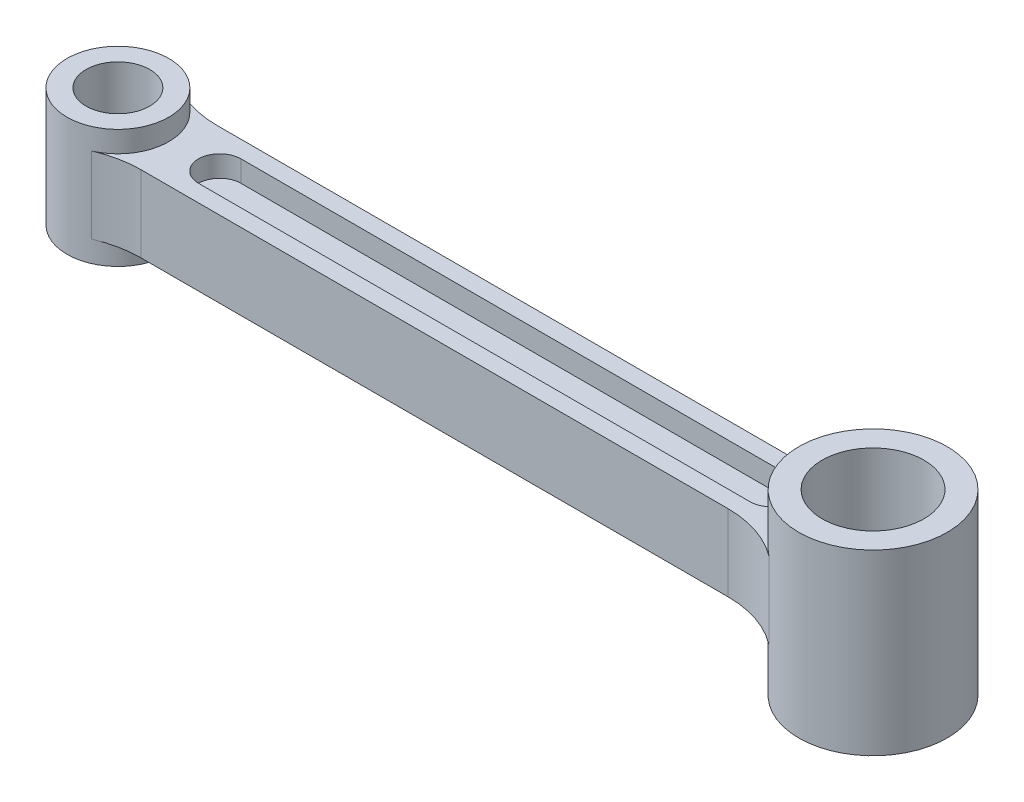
ISO-10303-21;
HEADER;
FILE_DESCRIPTION(('STEP AP214'),'2;1');
FILE_NAME('part.step','',(''),(''),'','','');
FILE_SCHEMA(('AUTOMOTIVE_DESIGN { 1 0 10303 214 1 1 1 1 }'));
ENDSEC;
DATA;
#1=APPLICATION_CONTEXT('core data for automotive mechanical design processes');
#2=APPLICATION_PROTOCOL_DEFINITION('international standard','automotive_design',2000,#1);
#3=PRODUCT_CONTEXT('',#1,'mechanical');
#4=PRODUCT('Part','Part','',(#3));
#5=PRODUCT_RELATED_PRODUCT_CATEGORY('part','',(#4));
#6=PRODUCT_DEFINITION_FORMATION('','',#4);
#7=PRODUCT_DEFINITION_CONTEXT('part definition',#1,'design');
#8=PRODUCT_DEFINITION('design','',#6,#7);
#9=PRODUCT_DEFINITION_SHAPE('','',#8);
#10=(LENGTH_UNIT() NAMED_UNIT(*) SI_UNIT(.MILLI.,.METRE.));
#11=(NAMED_UNIT(*) PLANE_ANGLE_UNIT() SI_UNIT($,.RADIAN.));
#12=(NAMED_UNIT(*) SI_UNIT($,.STERADIAN.) SOLID_ANGLE_UNIT());
#13=UNCERTAINTY_MEASURE_WITH_UNIT(LENGTH_MEASURE(1.E-05),#10,'distance_accuracy_value','');
#14=(GEOMETRIC_REPRESENTATION_CONTEXT(3) GLOBAL_UNCERTAINTY_ASSIGNED_CONTEXT((#13)) GLOBAL_UNIT_ASSIGNED_CONTEXT((#10,
#11,#12)) REPRESENTATION_CONTEXT('',''));
#15=CARTESIAN_POINT('',(0.,0.,0.));
#16=DIRECTION('',(0.,0.,1.));
#17=DIRECTION('',(1.,0.,0.));
#18=AXIS2_PLACEMENT_3D('',#15,#16,#17);
#19=CARTESIAN_POINT('',(-161.06840889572,-9.,0.));
#20=DIRECTION('',(0.,1.,0.));
#21=DIRECTION('',(0.,0.,1.));
#22=AXIS2_PLACEMENT_3D('',#19,#20,#21);
#23=PLANE('',#22);
#24=CARTESIAN_POINT('',(-89.,-9.,0.));
#25=DIRECTION('',(0.,1.,0.));
#26=DIRECTION('',(0.,0.,1.));
#27=AXIS2_PLACEMENT_3D('',#24,#25,#26);
#28=CIRCLE('',#27,12.);
#29=CARTESIAN_POINT('',(-84.2041684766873,-9.,11.));
#30=VERTEX_POINT('',#29);
#31=CARTESIAN_POINT('',(-84.2041684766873,-9.,-11.));
#32=VERTEX_POINT('',#31);
#33=EDGE_CURVE('E235',#30,#32,#28,.T.);
#34=ORIENTED_EDGE('',*,*,#33,.T.);
#35=CARTESIAN_POINT('',(-74.6125054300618,-9.,-33.));
#36=DIRECTION('',(0.,1.,0.));
#37=DIRECTION('',(0.,0.,1.));
#38=AXIS2_PLACEMENT_3D('',#35,#36,#37);
#39=CIRCLE('',#38,24.);
#40=CARTESIAN_POINT('',(-74.6125054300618,-9.,-9.));
#41=VERTEX_POINT('',#40);
#42=EDGE_CURVE('E243',#41,#32,#39,.F.);
#43=ORIENTED_EDGE('',*,*,#42,.F.);
#44=DIRECTION('',(1.,0.,0.));
#45=VECTOR('',#44,1.);
#46=CARTESIAN_POINT('',(-161.06840889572,-9.,-9.));
#47=LINE('',#46,#45);
#48=CARTESIAN_POINT('',(63.8355409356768,-9.,-9.));
#49=VERTEX_POINT('',#48);
#50=EDGE_CURVE('E276',#41,#49,#47,.T.);
#51=ORIENTED_EDGE('',*,*,#50,.T.);
#52=CARTESIAN_POINT('',(63.8355409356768,-9.,-33.));
#53=DIRECTION('',(0.,1.,0.));
#54=DIRECTION('',(0.,0.,1.));
#55=AXIS2_PLACEMENT_3D('',#52,#53,#54);
#56=CIRCLE('',#55,24.);
#57=CARTESIAN_POINT('',(78.3884811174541,-9.,-13.9156626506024));
#58=VERTEX_POINT('',#57);
#59=EDGE_CURVE('E274',#49,#58,#56,.T.);
#60=ORIENTED_EDGE('',*,*,#59,.T.);
#61=CARTESIAN_POINT('',(89.,-9.,0.));
#62=DIRECTION('',(0.,1.,0.));
#63=DIRECTION('',(0.,0.,1.));
#64=AXIS2_PLACEMENT_3D('',#61,#62,#63);
#65=CIRCLE('',#64,17.5);
#66=CARTESIAN_POINT('',(78.3884811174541,-9.,13.9156626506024));
#67=VERTEX_POINT('',#66);
#68=EDGE_CURVE('E271',#67,#58,#65,.F.);
#69=ORIENTED_EDGE('',*,*,#68,.F.);
#70=CARTESIAN_POINT('',(63.8355409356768,-9.,33.));
#71=DIRECTION('',(0.,1.,0.));
#72=DIRECTION('',(0.,0.,1.));
#73=AXIS2_PLACEMENT_3D('',#70,#71,#72);
#74=CIRCLE('',#73,24.);
#75=CARTESIAN_POINT('',(63.8355409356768,-9.,9.));
#76=VERTEX_POINT('',#75);
#77=EDGE_CURVE('E269',#76,#67,#74,.F.);
#78=ORIENTED_EDGE('',*,*,#77,.F.);
#79=DIRECTION('',(1.,0.,0.));
#80=VECTOR('',#79,1.);
#81=CARTESIAN_POINT('',(-161.06840889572,-9.,9.));
#82=LINE('',#81,#80);
#83=CARTESIAN_POINT('',(-74.6125054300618,-9.,9.));
#84=VERTEX_POINT('',#83);
#85=EDGE_CURVE('E267',#84,#76,#82,.T.);
#86=ORIENTED_EDGE('',*,*,#85,.F.);
#87=CARTESIAN_POINT('',(-74.6125054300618,-9.,33.));
#88=DIRECTION('',(0.,1.,0.));
#89=DIRECTION('',(0.,0.,1.));
#90=AXIS2_PLACEMENT_3D('',#87,#88,#89);
#91=CIRCLE('',#90,24.);
#92=EDGE_CURVE('E264',#84,#30,#91,.T.);
#93=ORIENTED_EDGE('',*,*,#92,.T.);
#94=EDGE_LOOP('',(#34,#43,#51,#60,#69,#78,#86,#93));
#95=FACE_BOUND('',#94,.T.);
#96=CARTESIAN_POINT('',(-65.,-9.,0.));
#97=DIRECTION('',(0.,1.,0.));
#98=DIRECTION('',(0.,0.,1.));
#99=AXIS2_PLACEMENT_3D('',#96,#97,#98);
#100=CIRCLE('',#99,5.);
#101=CARTESIAN_POINT('',(-65.,-9.,-5.));
#102=VERTEX_POINT('',#101);
#103=CARTESIAN_POINT('',(-65.,-9.,5.));
#104=VERTEX_POINT('',#103);
#105=EDGE_CURVE('E49',#102,#104,#100,.T.);
#106=ORIENTED_EDGE('',*,*,#105,.T.);
#107=DIRECTION('',(1.,0.,0.));
#108=VECTOR('',#107,1.);
#109=CARTESIAN_POINT('',(-65.,-9.,5.));
#110=LINE('',#109,#108);
#111=CARTESIAN_POINT('',(65.,-9.,5.));
#112=VERTEX_POINT('',#111);
#113=EDGE_CURVE('E167',#104,#112,#110,.T.);
#114=ORIENTED_EDGE('',*,*,#113,.T.);
#115=CARTESIAN_POINT('',(65.,-9.,0.));
#116=DIRECTION('',(0.,1.,0.));
#117=DIRECTION('',(0.,0.,1.));
#118=AXIS2_PLACEMENT_3D('',#115,#116,#117);
#119=CIRCLE('',#118,5.);
#120=CARTESIAN_POINT('',(65.,-9.,-5.));
#121=VERTEX_POINT('',#120);
#122=EDGE_CURVE('E170',#112,#121,#119,.T.);
#123=ORIENTED_EDGE('',*,*,#122,.T.);
#124=DIRECTION('',(-1.,0.,0.));
#125=VECTOR('',#124,1.);
#126=CARTESIAN_POINT('',(-65.,-9.,-5.));
#127=LINE('',#126,#125);
#128=EDGE_CURVE('E176',#121,#102,#127,.T.);
#129=ORIENTED_EDGE('',*,*,#128,.T.);
#130=EDGE_LOOP('',(#106,#114,#123,#129));
#131=FACE_BOUND('',#130,.T.);
#132=ADVANCED_FACE('F34',(#95,#131),#23,.F.);
#133=CARTESIAN_POINT('',(-74.6125054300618,9.,33.));
#134=DIRECTION('',(0.,-1.,0.));
#135=DIRECTION('',(0.,0.,-1.));
#136=AXIS2_PLACEMENT_3D('',#133,#134,#135);
#137=CYLINDRICAL_SURFACE('',#136,24.);
#138=ORIENTED_EDGE('',*,*,#92,.F.);
#139=DIRECTION('',(0.,-1.,0.));
#140=VECTOR('',#139,1.);
#141=CARTESIAN_POINT('',(-74.6125054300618,9.,9.));
#142=LINE('',#141,#140);
#143=CARTESIAN_POINT('',(-74.6125054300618,9.,9.));
#144=VERTEX_POINT('',#143);
#145=EDGE_CURVE('E42',#144,#84,#142,.T.);
#146=ORIENTED_EDGE('',*,*,#145,.F.);
#147=CARTESIAN_POINT('',(-74.6125054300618,9.,33.));
#148=DIRECTION('',(0.,1.,0.));
#149=DIRECTION('',(0.,0.,1.));
#150=AXIS2_PLACEMENT_3D('',#147,#148,#149);
#151=CIRCLE('',#150,24.);
#152=CARTESIAN_POINT('',(-84.2041684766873,9.,11.));
#153=VERTEX_POINT('',#152);
#154=EDGE_CURVE('E242',#144,#153,#151,.T.);
#155=ORIENTED_EDGE('',*,*,#154,.T.);
#156=DIRECTION('',(0.,-1.,0.));
#157=VECTOR('',#156,1.);
#158=CARTESIAN_POINT('',(-84.2041684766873,9.,11.));
#159=LINE('',#158,#157);
#160=EDGE_CURVE('E11',#153,#30,#159,.T.);
#161=ORIENTED_EDGE('',*,*,#160,.T.);
#162=EDGE_LOOP('',(#138,#146,#155,#161));
#163=FACE_BOUND('',#162,.T.);
#164=ADVANCED_FACE('F36',(#163),#137,.F.);
#165=CARTESIAN_POINT('',(-161.06840889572,9.,9.));
#166=DIRECTION('',(0.,0.,-1.));
#167=DIRECTION('',(-1.,0.,0.));
#168=AXIS2_PLACEMENT_3D('',#165,#166,#167);
#169=PLANE('',#168);
#170=ORIENTED_EDGE('',*,*,#85,.T.);
#171=DIRECTION('',(0.,-1.,0.));
#172=VECTOR('',#171,1.);
#173=CARTESIAN_POINT('',(63.8355409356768,9.,9.));
#174=LINE('',#173,#172);
#175=CARTESIAN_POINT('',(63.8355409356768,9.,9.));
#176=VERTEX_POINT('',#175);
#177=EDGE_CURVE('E292',#176,#76,#174,.T.);
#178=ORIENTED_EDGE('',*,*,#177,.F.);
#179=DIRECTION('',(1.,0.,0.));
#180=VECTOR('',#179,1.);
#181=CARTESIAN_POINT('',(-161.06840889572,9.,9.));
#182=LINE('',#181,#180);
#183=EDGE_CURVE('E246',#144,#176,#182,.T.);
#184=ORIENTED_EDGE('',*,*,#183,.F.);
#185=ORIENTED_EDGE('',*,*,#145,.T.);
#186=EDGE_LOOP('',(#170,#178,#184,#185));
#187=FACE_BOUND('',#186,.T.);
#188=ADVANCED_FACE('F297',(#187),#169,.F.);
#189=CARTESIAN_POINT('',(63.8355409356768,9.,33.));
#190=DIRECTION('',(0.,-1.,0.));
#191=DIRECTION('',(0.,0.,-1.));
#192=AXIS2_PLACEMENT_3D('',#189,#190,#191);
#193=CYLINDRICAL_SURFACE('',#192,24.);
#194=ORIENTED_EDGE('',*,*,#77,.T.);
#195=DIRECTION('',(0.,-1.,0.));
#196=VECTOR('',#195,1.);
#197=CARTESIAN_POINT('',(78.3884811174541,9.,13.9156626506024));
#198=LINE('',#197,#196);
#199=CARTESIAN_POINT('',(78.3884811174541,9.,13.9156626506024));
#200=VERTEX_POINT('',#199);
#201=EDGE_CURVE('E289',#200,#67,#198,.T.);
#202=ORIENTED_EDGE('',*,*,#201,.F.);
#203=CARTESIAN_POINT('',(63.8355409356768,9.,33.));
#204=DIRECTION('',(0.,1.,0.));
#205=DIRECTION('',(0.,0.,1.));
#206=AXIS2_PLACEMENT_3D('',#203,#204,#205);
#207=CIRCLE('',#206,24.);
#208=EDGE_CURVE('E248',#176,#200,#207,.F.);
#209=ORIENTED_EDGE('',*,*,#208,.F.);
#210=ORIENTED_EDGE('',*,*,#177,.T.);
#211=EDGE_LOOP('',(#194,#202,#209,#210));
#212=FACE_BOUND('',#211,.T.);
#213=ADVANCED_FACE('F333',(#212),#193,.F.);
#214=CARTESIAN_POINT('',(63.8355409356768,9.,-33.));
#215=DIRECTION('',(0.,-1.,0.));
#216=DIRECTION('',(0.,0.,-1.));
#217=AXIS2_PLACEMENT_3D('',#214,#215,#216);
#218=CYLINDRICAL_SURFACE('',#217,24.);
#219=ORIENTED_EDGE('',*,*,#59,.F.);
#220=DIRECTION('',(0.,-1.,0.));
#221=VECTOR('',#220,1.);
#222=CARTESIAN_POINT('',(63.8355409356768,9.,-9.));
#223=LINE('',#222,#221);
#224=CARTESIAN_POINT('',(63.8355409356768,9.,-9.));
#225=VERTEX_POINT('',#224);
#226=EDGE_CURVE('E284',#225,#49,#223,.T.);
#227=ORIENTED_EDGE('',*,*,#226,.F.);
#228=CARTESIAN_POINT('',(63.8355409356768,9.,-33.));
#229=DIRECTION('',(0.,1.,0.));
#230=DIRECTION('',(0.,0.,1.));
#231=AXIS2_PLACEMENT_3D('',#228,#229,#230);
#232=CIRCLE('',#231,24.);
#233=CARTESIAN_POINT('',(78.3884811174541,9.,-13.9156626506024));
#234=VERTEX_POINT('',#233);
#235=EDGE_CURVE('E252',#225,#234,#232,.T.);
#236=ORIENTED_EDGE('',*,*,#235,.T.);
#237=DIRECTION('',(0.,-1.,0.));
#238=VECTOR('',#237,1.);
#239=CARTESIAN_POINT('',(78.3884811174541,9.,-13.9156626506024));
#240=LINE('',#239,#238);
#241=EDGE_CURVE('E286',#234,#58,#240,.T.);
#242=ORIENTED_EDGE('',*,*,#241,.T.);
#243=EDGE_LOOP('',(#219,#227,#236,#242));
#244=FACE_BOUND('',#243,.T.);
#245=ADVANCED_FACE('F324',(#244),#218,.F.);
#246=CARTESIAN_POINT('',(-161.06840889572,9.,-9.));
#247=DIRECTION('',(0.,0.,-1.));
#248=DIRECTION('',(-1.,0.,0.));
#249=AXIS2_PLACEMENT_3D('',#246,#247,#248);
#250=PLANE('',#249);
#251=ORIENTED_EDGE('',*,*,#50,.F.);
#252=DIRECTION('',(0.,-1.,0.));
#253=VECTOR('',#252,1.);
#254=CARTESIAN_POINT('',(-74.6125054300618,9.,-9.));
#255=LINE('',#254,#253);
#256=CARTESIAN_POINT('',(-74.6125054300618,9.,-9.));
#257=VERTEX_POINT('',#256);
#258=EDGE_CURVE('E282',#257,#41,#255,.T.);
#259=ORIENTED_EDGE('',*,*,#258,.F.);
#260=DIRECTION('',(1.,0.,0.));
#261=VECTOR('',#260,1.);
#262=CARTESIAN_POINT('',(-161.06840889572,9.,-9.));
#263=LINE('',#262,#261);
#264=EDGE_CURVE('E255',#257,#225,#263,.T.);
#265=ORIENTED_EDGE('',*,*,#264,.T.);
#266=ORIENTED_EDGE('',*,*,#226,.T.);
#267=EDGE_LOOP('',(#251,#259,#265,#266));
#268=FACE_BOUND('',#267,.T.);
#269=ADVANCED_FACE('F321',(#268),#250,.T.);
#270=CARTESIAN_POINT('',(-74.6125054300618,9.,-33.));
#271=DIRECTION('',(0.,-1.,0.));
#272=DIRECTION('',(0.,0.,-1.));
#273=AXIS2_PLACEMENT_3D('',#270,#271,#272);
#274=CYLINDRICAL_SURFACE('',#273,24.);
#275=ORIENTED_EDGE('',*,*,#42,.T.);
#276=DIRECTION('',(0.,-1.,0.));
#277=VECTOR('',#276,1.);
#278=CARTESIAN_POINT('',(-84.2041684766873,9.,-11.));
#279=LINE('',#278,#277);
#280=CARTESIAN_POINT('',(-84.2041684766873,9.,-11.));
#281=VERTEX_POINT('',#280);
#282=EDGE_CURVE('E261',#281,#32,#279,.T.);
#283=ORIENTED_EDGE('',*,*,#282,.F.);
#284=CARTESIAN_POINT('',(-74.6125054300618,9.,-33.));
#285=DIRECTION('',(0.,1.,0.));
#286=DIRECTION('',(0.,0.,1.));
#287=AXIS2_PLACEMENT_3D('',#284,#285,#286);
#288=CIRCLE('',#287,24.);
#289=EDGE_CURVE('E258',#257,#281,#288,.F.);
#290=ORIENTED_EDGE('',*,*,#289,.F.);
#291=ORIENTED_EDGE('',*,*,#258,.T.);
#292=EDGE_LOOP('',(#275,#283,#290,#291));
#293=FACE_BOUND('',#292,.T.);
#294=ADVANCED_FACE('F317',(#293),#274,.F.);
#295=CARTESIAN_POINT('',(-161.06840889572,9.,0.));
#296=DIRECTION('',(0.,1.,0.));
#297=DIRECTION('',(0.,0.,1.));
#298=AXIS2_PLACEMENT_3D('',#295,#296,#297);
#299=PLANE('',#298);
#300=CARTESIAN_POINT('',(-65.,9.,0.));
#301=DIRECTION('',(0.,1.,0.));
#302=DIRECTION('',(0.,0.,1.));
#303=AXIS2_PLACEMENT_3D('',#300,#301,#302);
#304=CIRCLE('',#303,5.);
#305=CARTESIAN_POINT('',(-65.,9.,-5.));
#306=VERTEX_POINT('',#305);
#307=CARTESIAN_POINT('',(-65.,9.,5.));
#308=VERTEX_POINT('',#307);
#309=EDGE_CURVE('E57',#306,#308,#304,.T.);
#310=ORIENTED_EDGE('',*,*,#309,.F.);
#311=DIRECTION('',(-1.,0.,0.));
#312=VECTOR('',#311,1.);
#313=CARTESIAN_POINT('',(-65.,9.,-5.));
#314=LINE('',#313,#312);
#315=CARTESIAN_POINT('',(65.,9.,-5.));
#316=VERTEX_POINT('',#315);
#317=EDGE_CURVE('E189',#316,#306,#314,.T.);
#318=ORIENTED_EDGE('',*,*,#317,.F.);
#319=CARTESIAN_POINT('',(65.,9.,0.));
#320=DIRECTION('',(0.,1.,0.));
#321=DIRECTION('',(0.,0.,1.));
#322=AXIS2_PLACEMENT_3D('',#319,#320,#321);
#323=CIRCLE('',#322,5.);
#324=CARTESIAN_POINT('',(65.,9.,5.));
#325=VERTEX_POINT('',#324);
#326=EDGE_CURVE('E203',#325,#316,#323,.T.);
#327=ORIENTED_EDGE('',*,*,#326,.F.);
#328=DIRECTION('',(1.,0.,0.));
#329=VECTOR('',#328,1.);
#330=CARTESIAN_POINT('',(-65.,9.,5.));
#331=LINE('',#330,#329);
#332=EDGE_CURVE('E200',#308,#325,#331,.T.);
#333=ORIENTED_EDGE('',*,*,#332,.F.);
#334=EDGE_LOOP('',(#310,#318,#327,#333));
#335=FACE_BOUND('',#334,.T.);
#336=CARTESIAN_POINT('',(-89.,9.,0.));
#337=DIRECTION('',(0.,1.,0.));
#338=DIRECTION('',(0.,0.,1.));
#339=AXIS2_PLACEMENT_3D('',#336,#337,#338);
#340=CIRCLE('',#339,12.);
#341=EDGE_CURVE('E240',#153,#281,#340,.T.);
#342=ORIENTED_EDGE('',*,*,#341,.F.);
#343=ORIENTED_EDGE('',*,*,#154,.F.);
#344=ORIENTED_EDGE('',*,*,#183,.T.);
#345=ORIENTED_EDGE('',*,*,#208,.T.);
#346=CARTESIAN_POINT('',(89.,9.,0.));
#347=DIRECTION('',(0.,1.,0.));
#348=DIRECTION('',(0.,0.,1.));
#349=AXIS2_PLACEMENT_3D('',#346,#347,#348);
#350=CIRCLE('',#349,17.5);
#351=EDGE_CURVE('E250',#200,#234,#350,.F.);
#352=ORIENTED_EDGE('',*,*,#351,.T.);
#353=ORIENTED_EDGE('',*,*,#235,.F.);
#354=ORIENTED_EDGE('',*,*,#264,.F.);
#355=ORIENTED_EDGE('',*,*,#289,.T.);
#356=EDGE_LOOP('',(#342,#343,#344,#345,#352,#353,#354,#355));
#357=FACE_BOUND('',#356,.T.);
#358=ADVANCED_FACE('F311',(#335,#357),#299,.T.);
#359=CARTESIAN_POINT('',(-89.,14.,0.));
#360=DIRECTION('',(0.,-1.,0.));
#361=DIRECTION('',(0.,0.,-1.));
#362=AXIS2_PLACEMENT_3D('',#359,#360,#361);
#363=CYLINDRICAL_SURFACE('',#362,12.);
#364=ORIENTED_EDGE('',*,*,#341,.T.);
#365=ORIENTED_EDGE('',*,*,#282,.T.);
#366=ORIENTED_EDGE('',*,*,#33,.F.);
#367=ORIENTED_EDGE('',*,*,#160,.F.);
#368=EDGE_LOOP('',(#364,#365,#366,#367));
#369=FACE_BOUND('',#368,.T.);
#370=CARTESIAN_POINT('',(-89.,14.,0.));
#371=DIRECTION('',(0.,1.,0.));
#372=DIRECTION('',(0.,0.,1.));
#373=AXIS2_PLACEMENT_3D('',#370,#371,#372);
#374=CIRCLE('',#373,12.);
#375=CARTESIAN_POINT('',(-89.,14.,12.));
#376=VERTEX_POINT('',#375);
#377=EDGE_CURVE('E228',#376,#376,#374,.T.);
#378=ORIENTED_EDGE('',*,*,#377,.F.);
#379=EDGE_LOOP('',(#378));
#380=FACE_BOUND('',#379,.T.);
#381=CARTESIAN_POINT('',(-89.,-14.,0.));
#382=DIRECTION('',(0.,1.,0.));
#383=DIRECTION('',(0.,0.,1.));
#384=AXIS2_PLACEMENT_3D('',#381,#382,#383);
#385=CIRCLE('',#384,12.);
#386=CARTESIAN_POINT('',(-89.,-14.,12.));
#387=VERTEX_POINT('',#386);
#388=EDGE_CURVE('E223',#387,#387,#385,.T.);
#389=ORIENTED_EDGE('',*,*,#388,.T.);
#390=EDGE_LOOP('',(#389));
#391=FACE_BOUND('',#390,.T.);
#392=ADVANCED_FACE('F308',(#369,#380,#391),#363,.T.);
#393=CARTESIAN_POINT('',(-89.,14.,0.));
#394=DIRECTION('',(0.,-1.,0.));
#395=DIRECTION('',(0.,0.,-1.));
#396=AXIS2_PLACEMENT_3D('',#393,#394,#395);
#397=CYLINDRICAL_SURFACE('',#396,7.50000000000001);
#398=CARTESIAN_POINT('',(-89.,14.,0.));
#399=DIRECTION('',(0.,1.,0.));
#400=DIRECTION('',(0.,0.,1.));
#401=AXIS2_PLACEMENT_3D('',#398,#399,#400);
#402=CIRCLE('',#401,7.50000000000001);
#403=CARTESIAN_POINT('',(-89.,14.,7.50000000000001));
#404=VERTEX_POINT('',#403);
#405=EDGE_CURVE('E231',#404,#404,#402,.T.);
#406=ORIENTED_EDGE('',*,*,#405,.T.);
#407=EDGE_LOOP('',(#406));
#408=FACE_BOUND('',#407,.T.);
#409=CARTESIAN_POINT('',(-89.,-14.,0.));
#410=DIRECTION('',(0.,1.,0.));
#411=DIRECTION('',(0.,0.,1.));
#412=AXIS2_PLACEMENT_3D('',#409,#410,#411);
#413=CIRCLE('',#412,7.50000000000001);
#414=CARTESIAN_POINT('',(-89.,-14.,7.50000000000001));
#415=VERTEX_POINT('',#414);
#416=EDGE_CURVE('E232',#415,#415,#413,.T.);
#417=ORIENTED_EDGE('',*,*,#416,.F.);
#418=EDGE_LOOP('',(#417));
#419=FACE_BOUND('',#418,.T.);
#420=ADVANCED_FACE('F376',(#408,#419),#397,.F.);
#421=CARTESIAN_POINT('',(-161.06840889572,14.,0.));
#422=DIRECTION('',(0.,1.,0.));
#423=DIRECTION('',(0.,0.,1.));
#424=AXIS2_PLACEMENT_3D('',#421,#422,#423);
#425=PLANE('',#424);
#426=ORIENTED_EDGE('',*,*,#377,.T.);
#427=EDGE_LOOP('',(#426));
#428=FACE_BOUND('',#427,.T.);
#429=ORIENTED_EDGE('',*,*,#405,.F.);
#430=EDGE_LOOP('',(#429));
#431=FACE_BOUND('',#430,.T.);
#432=ADVANCED_FACE('F382',(#428,#431),#425,.T.);
#433=CARTESIAN_POINT('',(-161.06840889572,-14.,0.));
#434=DIRECTION('',(0.,1.,0.));
#435=DIRECTION('',(0.,0.,1.));
#436=AXIS2_PLACEMENT_3D('',#433,#434,#435);
#437=PLANE('',#436);
#438=ORIENTED_EDGE('',*,*,#388,.F.);
#439=EDGE_LOOP('',(#438));
#440=FACE_BOUND('',#439,.T.);
#441=ORIENTED_EDGE('',*,*,#416,.T.);
#442=EDGE_LOOP('',(#441));
#443=FACE_BOUND('',#442,.T.);
#444=ADVANCED_FACE('F390',(#440,#443),#437,.F.);
#445=CARTESIAN_POINT('',(89.,21.,0.));
#446=DIRECTION('',(0.,-1.,0.));
#447=DIRECTION('',(0.,0.,-1.));
#448=AXIS2_PLACEMENT_3D('',#445,#446,#447);
#449=CYLINDRICAL_SURFACE('',#448,12.);
#450=CARTESIAN_POINT('',(89.,21.,0.));
#451=DIRECTION('',(0.,1.,0.));
#452=DIRECTION('',(0.,0.,1.));
#453=AXIS2_PLACEMENT_3D('',#450,#451,#452);
#454=CIRCLE('',#453,12.);
#455=CARTESIAN_POINT('',(89.,21.,-12.));
#456=VERTEX_POINT('',#455);
#457=EDGE_CURVE('E216',#456,#456,#454,.T.);
#458=CARTESIAN_POINT('',(89.,-21.,0.));
#459=DIRECTION('',(0.,1.,0.));
#460=DIRECTION('',(0.,0.,1.));
#461=AXIS2_PLACEMENT_3D('',#458,#459,#460);
#462=CIRCLE('',#461,12.);
#463=CARTESIAN_POINT('',(89.,-21.,-12.));
#464=VERTEX_POINT('',#463);
#465=EDGE_CURVE('E210',#464,#464,#462,.T.);
#466=CARTESIAN_POINT('',(89.,21.,-12.));
#467=CARTESIAN_POINT('',(89.,20.5625,-12.));
#468=CARTESIAN_POINT('',(89.,20.125,-12.));
#469=CARTESIAN_POINT('',(89.,19.25,-12.));
#470=CARTESIAN_POINT('',(89.,18.8125,-12.));
#471=CARTESIAN_POINT('',(89.,17.9375,-12.));
#472=CARTESIAN_POINT('',(89.,17.5,-12.));
#473=CARTESIAN_POINT('',(89.,16.625,-12.));
#474=CARTESIAN_POINT('',(89.,16.1875,-12.));
#475=CARTESIAN_POINT('',(89.,15.3125,-12.));
#476=CARTESIAN_POINT('',(89.,14.875,-12.));
#477=CARTESIAN_POINT('',(89.,14.,-12.));
#478=CARTESIAN_POINT('',(89.,13.5625,-12.));
#479=CARTESIAN_POINT('',(89.,12.6875,-12.));
#480=CARTESIAN_POINT('',(89.,12.25,-12.));
#481=CARTESIAN_POINT('',(89.,11.375,-12.));
#482=CARTESIAN_POINT('',(89.,10.9375,-12.));
#483=CARTESIAN_POINT('',(89.,10.0625,-12.));
#484=CARTESIAN_POINT('',(89.,9.625,-12.));
#485=CARTESIAN_POINT('',(89.,8.75,-12.));
#486=CARTESIAN_POINT('',(89.,8.3125,-12.));
#487=CARTESIAN_POINT('',(89.,7.4375,-12.));
#488=CARTESIAN_POINT('',(89.,7.,-12.));
#489=CARTESIAN_POINT('',(89.,6.125,-12.));
#490=CARTESIAN_POINT('',(89.,5.6875,-12.));
#491=CARTESIAN_POINT('',(89.,4.8125,-12.));
#492=CARTESIAN_POINT('',(89.,4.375,-12.));
#493=CARTESIAN_POINT('',(89.,3.5,-12.));
#494=CARTESIAN_POINT('',(89.,3.0625,-12.));
#495=CARTESIAN_POINT('',(89.,2.1875,-12.));
#496=CARTESIAN_POINT('',(89.,1.75,-12.));
#497=CARTESIAN_POINT('',(89.,0.874999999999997,-12.));
#498=CARTESIAN_POINT('',(89.,0.437499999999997,-12.));
#499=CARTESIAN_POINT('',(89.,-0.437500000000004,-12.));
#500=CARTESIAN_POINT('',(89.,-0.875000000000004,-12.));
#501=CARTESIAN_POINT('',(89.,-1.75000000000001,-12.));
#502=CARTESIAN_POINT('',(89.,-2.18750000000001,-12.));
#503=CARTESIAN_POINT('',(89.,-3.0625,-12.));
#504=CARTESIAN_POINT('',(89.,-3.5,-12.));
#505=CARTESIAN_POINT('',(89.,-4.375,-12.));
#506=CARTESIAN_POINT('',(89.,-4.8125,-12.));
#507=CARTESIAN_POINT('',(89.,-5.68750000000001,-12.));
#508=CARTESIAN_POINT('',(89.,-6.12500000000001,-12.));
#509=CARTESIAN_POINT('',(89.,-7.00000000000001,-12.));
#510=CARTESIAN_POINT('',(89.,-7.4375,-12.));
#511=CARTESIAN_POINT('',(89.,-8.3125,-12.));
#512=CARTESIAN_POINT('',(89.,-8.75,-12.));
#513=CARTESIAN_POINT('',(89.,-9.625,-12.));
#514=CARTESIAN_POINT('',(89.,-10.0625,-12.));
#515=CARTESIAN_POINT('',(89.,-10.9375,-12.));
#516=CARTESIAN_POINT('',(89.,-11.375,-12.));
#517=CARTESIAN_POINT('',(89.,-12.25,-12.));
#518=CARTESIAN_POINT('',(89.,-12.6875,-12.));
#519=CARTESIAN_POINT('',(89.,-13.5625,-12.));
#520=CARTESIAN_POINT('',(89.,-14.,-12.));
#521=CARTESIAN_POINT('',(89.,-14.875,-12.));
#522=CARTESIAN_POINT('',(89.,-15.3125,-12.));
#523=CARTESIAN_POINT('',(89.,-16.1875,-12.));
#524=CARTESIAN_POINT('',(89.,-16.625,-12.));
#525=CARTESIAN_POINT('',(89.,-17.5,-12.));
#526=CARTESIAN_POINT('',(89.,-17.9375,-12.));
#527=CARTESIAN_POINT('',(89.,-18.8125,-12.));
#528=CARTESIAN_POINT('',(89.,-19.25,-12.));
#529=CARTESIAN_POINT('',(89.,-20.125,-12.));
#530=CARTESIAN_POINT('',(89.,-20.5625,-12.));
#531=CARTESIAN_POINT('',(89.,-21.,-12.));
#532=B_SPLINE_CURVE_WITH_KNOTS('',3,(#466,#467,#468,#469,#470,#471,#472,#473,#474,#475,#476,
#477,#478,#479,#480,#481,#482,#483,#484,#485,#486,#487,#488,#489,#490,#491,#492,#493,#494,#495,
#496,#497,#498,#499,#500,#501,#502,#503,#504,#505,#506,#507,#508,#509,#510,#511,#512,#513,#514,
#515,#516,#517,#518,#519,#520,#521,#522,#523,#524,#525,#526,#527,#528,#529,#530,#531),
.UNSPECIFIED.,.F.,.F.,(4,2,2,2,2,2,2,2,2,2,2,2,2,2,2,2,2,2,2,2,2,2,2,2,2,2,2,2,2,2,2,2,4),(0.,
1.3125,2.625,3.9375,5.25,6.5625,7.875,9.1875,10.5,11.8125,13.125,14.4375,15.75,17.0625,18.375,
19.6875,21.,22.3125,23.625,24.9375,26.25,27.5625,28.875,30.1875,31.5,32.8125,34.125,35.4375,
36.75,38.0625,39.375,40.6875,42.),.UNSPECIFIED.);
#533=EDGE_CURVE('BSEAM398',#456,#464,#532,.T.);
#534=ORIENTED_EDGE('',*,*,#457,.T.);
#535=ORIENTED_EDGE('',*,*,#465,.F.);
#536=ORIENTED_EDGE('',*,*,#533,.T.);
#537=ORIENTED_EDGE('',*,*,#533,.F.);
#538=EDGE_LOOP('',(#534,#536,#535,#537));
#539=FACE_BOUND('',#538,.T.);
#540=ADVANCED_FACE('F398',(#539),#449,.F.);
#541=CARTESIAN_POINT('',(89.,21.,0.));
#542=DIRECTION('',(0.,-1.,0.));
#543=DIRECTION('',(0.,0.,-1.));
#544=AXIS2_PLACEMENT_3D('',#541,#542,#543);
#545=CYLINDRICAL_SURFACE('',#544,17.5);
#546=ORIENTED_EDGE('',*,*,#241,.F.);
#547=ORIENTED_EDGE('',*,*,#351,.F.);
#548=ORIENTED_EDGE('',*,*,#201,.T.);
#549=ORIENTED_EDGE('',*,*,#68,.T.);
#550=EDGE_LOOP('',(#546,#547,#548,#549));
#551=FACE_BOUND('',#550,.T.);
#552=CARTESIAN_POINT('',(89.,21.,0.));
#553=DIRECTION('',(0.,1.,0.));
#554=DIRECTION('',(0.,0.,1.));
#555=AXIS2_PLACEMENT_3D('',#552,#553,#554);
#556=CIRCLE('',#555,17.5);
#557=CARTESIAN_POINT('',(89.,21.,17.5));
#558=VERTEX_POINT('',#557);
#559=EDGE_CURVE('E219',#558,#558,#556,.F.);
#560=ORIENTED_EDGE('',*,*,#559,.T.);
#561=EDGE_LOOP('',(#560));
#562=FACE_BOUND('',#561,.T.);
#563=CARTESIAN_POINT('',(89.,-21.,0.));
#564=DIRECTION('',(0.,1.,0.));
#565=DIRECTION('',(0.,0.,1.));
#566=AXIS2_PLACEMENT_3D('',#563,#564,#565);
#567=CIRCLE('',#566,17.5);
#568=CARTESIAN_POINT('',(89.,-21.,17.5));
#569=VERTEX_POINT('',#568);
#570=EDGE_CURVE('E220',#569,#569,#567,.F.);
#571=ORIENTED_EDGE('',*,*,#570,.F.);
#572=EDGE_LOOP('',(#571));
#573=FACE_BOUND('',#572,.T.);
#574=ADVANCED_FACE('F329',(#551,#562,#573),#545,.T.);
#575=CARTESIAN_POINT('',(-161.06840889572,21.,0.));
#576=DIRECTION('',(0.,1.,0.));
#577=DIRECTION('',(0.,0.,1.));
#578=AXIS2_PLACEMENT_3D('',#575,#576,#577);
#579=PLANE('',#578);
#580=ORIENTED_EDGE('',*,*,#457,.F.);
#581=EDGE_LOOP('',(#580));
#582=FACE_BOUND('',#581,.T.);
#583=ORIENTED_EDGE('',*,*,#559,.F.);
#584=EDGE_LOOP('',(#583));
#585=FACE_BOUND('',#584,.T.);
#586=ADVANCED_FACE('F413',(#582,#585),#579,.T.);
#587=CARTESIAN_POINT('',(-161.06840889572,-21.,0.));
#588=DIRECTION('',(0.,1.,0.));
#589=DIRECTION('',(0.,0.,1.));
#590=AXIS2_PLACEMENT_3D('',#587,#588,#589);
#591=PLANE('',#590);
#592=ORIENTED_EDGE('',*,*,#465,.T.);
#593=EDGE_LOOP('',(#592));
#594=FACE_BOUND('',#593,.T.);
#595=ORIENTED_EDGE('',*,*,#570,.T.);
#596=EDGE_LOOP('',(#595));
#597=FACE_BOUND('',#596,.T.);
#598=ADVANCED_FACE('F420',(#594,#597),#591,.F.);
#599=CARTESIAN_POINT('',(-65.,4.,0.));
#600=DIRECTION('',(0.,1.,0.));
#601=DIRECTION('',(0.,0.,1.));
#602=AXIS2_PLACEMENT_3D('',#599,#600,#601);
#603=CYLINDRICAL_SURFACE('',#602,5.);
#604=ORIENTED_EDGE('',*,*,#309,.T.);
#605=DIRECTION('',(0.,1.,0.));
#606=VECTOR('',#605,1.);
#607=CARTESIAN_POINT('',(-65.,4.,5.));
#608=LINE('',#607,#606);
#609=CARTESIAN_POINT('',(-65.,4.,5.));
#610=VERTEX_POINT('',#609);
#611=EDGE_CURVE('E198',#610,#308,#608,.T.);
#612=ORIENTED_EDGE('',*,*,#611,.F.);
#613=CARTESIAN_POINT('',(-65.,4.,0.));
#614=DIRECTION('',(0.,1.,0.));
#615=DIRECTION('',(0.,0.,1.));
#616=AXIS2_PLACEMENT_3D('',#613,#614,#615);
#617=CIRCLE('',#616,5.);
#618=CARTESIAN_POINT('',(-65.,4.,-5.));
#619=VERTEX_POINT('',#618);
#620=EDGE_CURVE('E185',#619,#610,#617,.T.);
#621=ORIENTED_EDGE('',*,*,#620,.F.);
#622=DIRECTION('',(0.,1.,0.));
#623=VECTOR('',#622,1.);
#624=CARTESIAN_POINT('',(-65.,4.,-5.));
#625=LINE('',#624,#623);
#626=EDGE_CURVE('E208',#619,#306,#625,.T.);
#627=ORIENTED_EDGE('',*,*,#626,.T.);
#628=EDGE_LOOP('',(#604,#612,#621,#627));
#629=FACE_BOUND('',#628,.T.);
#630=ADVANCED_FACE('F427',(#629),#603,.F.);
#631=CARTESIAN_POINT('',(-65.,4.,-5.));
#632=DIRECTION('',(0.,0.,-1.));
#633=DIRECTION('',(-1.,0.,0.));
#634=AXIS2_PLACEMENT_3D('',#631,#632,#633);
#635=PLANE('',#634);
#636=ORIENTED_EDGE('',*,*,#317,.T.);
#637=ORIENTED_EDGE('',*,*,#626,.F.);
#638=DIRECTION('',(-1.,0.,0.));
#639=VECTOR('',#638,1.);
#640=CARTESIAN_POINT('',(-65.,4.,-5.));
#641=LINE('',#640,#639);
#642=CARTESIAN_POINT('',(65.,4.,-5.));
#643=VERTEX_POINT('',#642);
#644=EDGE_CURVE('E195',#643,#619,#641,.T.);
#645=ORIENTED_EDGE('',*,*,#644,.F.);
#646=DIRECTION('',(0.,1.,0.));
#647=VECTOR('',#646,1.);
#648=CARTESIAN_POINT('',(65.,4.,-5.));
#649=LINE('',#648,#647);
#650=EDGE_CURVE('E211',#643,#316,#649,.T.);
#651=ORIENTED_EDGE('',*,*,#650,.T.);
#652=EDGE_LOOP('',(#636,#637,#645,#651));
#653=FACE_BOUND('',#652,.T.);
#654=ADVANCED_FACE('F434',(#653),#635,.F.);
#655=CARTESIAN_POINT('',(65.,4.,0.));
#656=DIRECTION('',(0.,1.,0.));
#657=DIRECTION('',(0.,0.,1.));
#658=AXIS2_PLACEMENT_3D('',#655,#656,#657);
#659=CYLINDRICAL_SURFACE('',#658,5.);
#660=ORIENTED_EDGE('',*,*,#326,.T.);
#661=ORIENTED_EDGE('',*,*,#650,.F.);
#662=CARTESIAN_POINT('',(65.,4.,0.));
#663=DIRECTION('',(0.,1.,0.));
#664=DIRECTION('',(0.,0.,1.));
#665=AXIS2_PLACEMENT_3D('',#662,#663,#664);
#666=CIRCLE('',#665,5.);
#667=CARTESIAN_POINT('',(65.,4.,5.));
#668=VERTEX_POINT('',#667);
#669=EDGE_CURVE('E192',#668,#643,#666,.T.);
#670=ORIENTED_EDGE('',*,*,#669,.F.);
#671=DIRECTION('',(0.,1.,0.));
#672=VECTOR('',#671,1.);
#673=CARTESIAN_POINT('',(65.,4.,5.));
#674=LINE('',#673,#672);
#675=EDGE_CURVE('E213',#668,#325,#674,.T.);
#676=ORIENTED_EDGE('',*,*,#675,.T.);
#677=EDGE_LOOP('',(#660,#661,#670,#676));
#678=FACE_BOUND('',#677,.T.);
#679=ADVANCED_FACE('F441',(#678),#659,.F.);
#680=CARTESIAN_POINT('',(-65.,4.,5.));
#681=DIRECTION('',(0.,0.,1.));
#682=DIRECTION('',(1.,0.,0.));
#683=AXIS2_PLACEMENT_3D('',#680,#681,#682);
#684=PLANE('',#683);
#685=ORIENTED_EDGE('',*,*,#332,.T.);
#686=ORIENTED_EDGE('',*,*,#675,.F.);
#687=DIRECTION('',(1.,0.,0.));
#688=VECTOR('',#687,1.);
#689=CARTESIAN_POINT('',(-65.,4.,5.));
#690=LINE('',#689,#688);
#691=EDGE_CURVE('E188',#610,#668,#690,.T.);
#692=ORIENTED_EDGE('',*,*,#691,.F.);
#693=ORIENTED_EDGE('',*,*,#611,.T.);
#694=EDGE_LOOP('',(#685,#686,#692,#693));
#695=FACE_BOUND('',#694,.T.);
#696=ADVANCED_FACE('F449',(#695),#684,.F.);
#697=CARTESIAN_POINT('',(-65.,4.,0.));
#698=DIRECTION('',(0.,1.,0.));
#699=DIRECTION('',(0.,0.,1.));
#700=AXIS2_PLACEMENT_3D('',#697,#698,#699);
#701=PLANE('',#700);
#702=ORIENTED_EDGE('',*,*,#620,.T.);
#703=ORIENTED_EDGE('',*,*,#691,.T.);
#704=ORIENTED_EDGE('',*,*,#669,.T.);
#705=ORIENTED_EDGE('',*,*,#644,.T.);
#706=EDGE_LOOP('',(#702,#703,#704,#705));
#707=FACE_BOUND('',#706,.T.);
#708=ADVANCED_FACE('F457',(#707),#701,.T.);
#709=CARTESIAN_POINT('',(-65.,-4.,0.));
#710=DIRECTION('',(0.,-1.,0.));
#711=DIRECTION('',(0.,0.,-1.));
#712=AXIS2_PLACEMENT_3D('',#709,#710,#711);
#713=CYLINDRICAL_SURFACE('',#712,5.);
#714=ORIENTED_EDGE('',*,*,#105,.F.);
#715=DIRECTION('',(0.,-1.,0.));
#716=VECTOR('',#715,1.);
#717=CARTESIAN_POINT('',(-65.,-4.,-5.));
#718=LINE('',#717,#716);
#719=CARTESIAN_POINT('',(-65.,-4.,-5.));
#720=VERTEX_POINT('',#719);
#721=EDGE_CURVE('E152',#720,#102,#718,.T.);
#722=ORIENTED_EDGE('',*,*,#721,.F.);
#723=CARTESIAN_POINT('',(-65.,-4.,0.));
#724=DIRECTION('',(0.,1.,0.));
#725=DIRECTION('',(0.,0.,1.));
#726=AXIS2_PLACEMENT_3D('',#723,#724,#725);
#727=CIRCLE('',#726,5.);
#728=CARTESIAN_POINT('',(-65.,-4.,5.));
#729=VERTEX_POINT('',#728);
#730=EDGE_CURVE('E159',#720,#729,#727,.T.);
#731=ORIENTED_EDGE('',*,*,#730,.T.);
#732=DIRECTION('',(0.,-1.,0.));
#733=VECTOR('',#732,1.);
#734=CARTESIAN_POINT('',(-65.,-4.,5.));
#735=LINE('',#734,#733);
#736=EDGE_CURVE('E180',#729,#104,#735,.T.);
#737=ORIENTED_EDGE('',*,*,#736,.T.);
#738=EDGE_LOOP('',(#714,#722,#731,#737));
#739=FACE_BOUND('',#738,.T.);
#740=ADVANCED_FACE('F162',(#739),#713,.F.);
#741=CARTESIAN_POINT('',(-65.,-4.,5.));
#742=DIRECTION('',(0.,0.,-1.));
#743=DIRECTION('',(-1.,0.,0.));
#744=AXIS2_PLACEMENT_3D('',#741,#742,#743);
#745=PLANE('',#744);
#746=ORIENTED_EDGE('',*,*,#113,.F.);
#747=ORIENTED_EDGE('',*,*,#736,.F.);
#748=DIRECTION('',(1.,0.,0.));
#749=VECTOR('',#748,1.);
#750=CARTESIAN_POINT('',(-65.,-4.,5.));
#751=LINE('',#750,#749);
#752=CARTESIAN_POINT('',(65.,-4.,5.));
#753=VERTEX_POINT('',#752);
#754=EDGE_CURVE('E164',#729,#753,#751,.T.);
#755=ORIENTED_EDGE('',*,*,#754,.T.);
#756=DIRECTION('',(0.,-1.,0.));
#757=VECTOR('',#756,1.);
#758=CARTESIAN_POINT('',(65.,-4.,5.));
#759=LINE('',#758,#757);
#760=EDGE_CURVE('E182',#753,#112,#759,.T.);
#761=ORIENTED_EDGE('',*,*,#760,.T.);
#762=EDGE_LOOP('',(#746,#747,#755,#761));
#763=FACE_BOUND('',#762,.T.);
#764=ADVANCED_FACE('F472',(#763),#745,.T.);
#765=CARTESIAN_POINT('',(65.,-4.,0.));
#766=DIRECTION('',(0.,-1.,0.));
#767=DIRECTION('',(0.,0.,-1.));
#768=AXIS2_PLACEMENT_3D('',#765,#766,#767);
#769=CYLINDRICAL_SURFACE('',#768,5.);
#770=ORIENTED_EDGE('',*,*,#122,.F.);
#771=ORIENTED_EDGE('',*,*,#760,.F.);
#772=CARTESIAN_POINT('',(65.,-4.,0.));
#773=DIRECTION('',(0.,1.,0.));
#774=DIRECTION('',(0.,0.,1.));
#775=AXIS2_PLACEMENT_3D('',#772,#773,#774);
#776=CIRCLE('',#775,5.);
#777=CARTESIAN_POINT('',(65.,-4.,-5.));
#778=VERTEX_POINT('',#777);
#779=EDGE_CURVE('E158',#753,#778,#776,.T.);
#780=ORIENTED_EDGE('',*,*,#779,.T.);
#781=DIRECTION('',(0.,-1.,0.));
#782=VECTOR('',#781,1.);
#783=CARTESIAN_POINT('',(65.,-4.,-5.));
#784=LINE('',#783,#782);
#785=EDGE_CURVE('E154',#778,#121,#784,.T.);
#786=ORIENTED_EDGE('',*,*,#785,.T.);
#787=EDGE_LOOP('',(#770,#771,#780,#786));
#788=FACE_BOUND('',#787,.T.);
#789=ADVANCED_FACE('F479',(#788),#769,.F.);
#790=CARTESIAN_POINT('',(-65.,-4.,-5.));
#791=DIRECTION('',(0.,0.,1.));
#792=DIRECTION('',(1.,0.,0.));
#793=AXIS2_PLACEMENT_3D('',#790,#791,#792);
#794=PLANE('',#793);
#795=ORIENTED_EDGE('',*,*,#128,.F.);
#796=ORIENTED_EDGE('',*,*,#785,.F.);
#797=DIRECTION('',(-1.,0.,0.));
#798=VECTOR('',#797,1.);
#799=CARTESIAN_POINT('',(-65.,-4.,-5.));
#800=LINE('',#799,#798);
#801=EDGE_CURVE('E149',#778,#720,#800,.T.);
#802=ORIENTED_EDGE('',*,*,#801,.T.);
#803=ORIENTED_EDGE('',*,*,#721,.T.);
#804=EDGE_LOOP('',(#795,#796,#802,#803));
#805=FACE_BOUND('',#804,.T.);
#806=ADVANCED_FACE('F151',(#805),#794,.T.);
#807=CARTESIAN_POINT('',(-65.,-4.,0.));
#808=DIRECTION('',(0.,-1.,0.));
#809=DIRECTION('',(0.,0.,1.));
#810=AXIS2_PLACEMENT_3D('',#807,#808,#809);
#811=PLANE('',#810);
#812=ORIENTED_EDGE('',*,*,#730,.F.);
#813=ORIENTED_EDGE('',*,*,#801,.F.);
#814=ORIENTED_EDGE('',*,*,#779,.F.);
#815=ORIENTED_EDGE('',*,*,#754,.F.);
#816=EDGE_LOOP('',(#812,#813,#814,#815));
#817=FACE_BOUND('',#816,.T.);
#818=ADVANCED_FACE('F166',(#817),#811,.T.);
#819=CLOSED_SHELL('',(#132,#164,#188,#213,#245,#269,#294,#358,#392,#420,#432,#444,#540,#574,
#586,#598,#630,#654,#679,#696,#708,#740,#764,#789,#806,#818));
#820=MANIFOLD_SOLID_BREP('B2',#819);
#821=ADVANCED_BREP_SHAPE_REPRESENTATION('',(#18,#820),#14);
#822=SHAPE_DEFINITION_REPRESENTATION(#9,#821);
ENDSEC;
END-ISO-10303-21;
